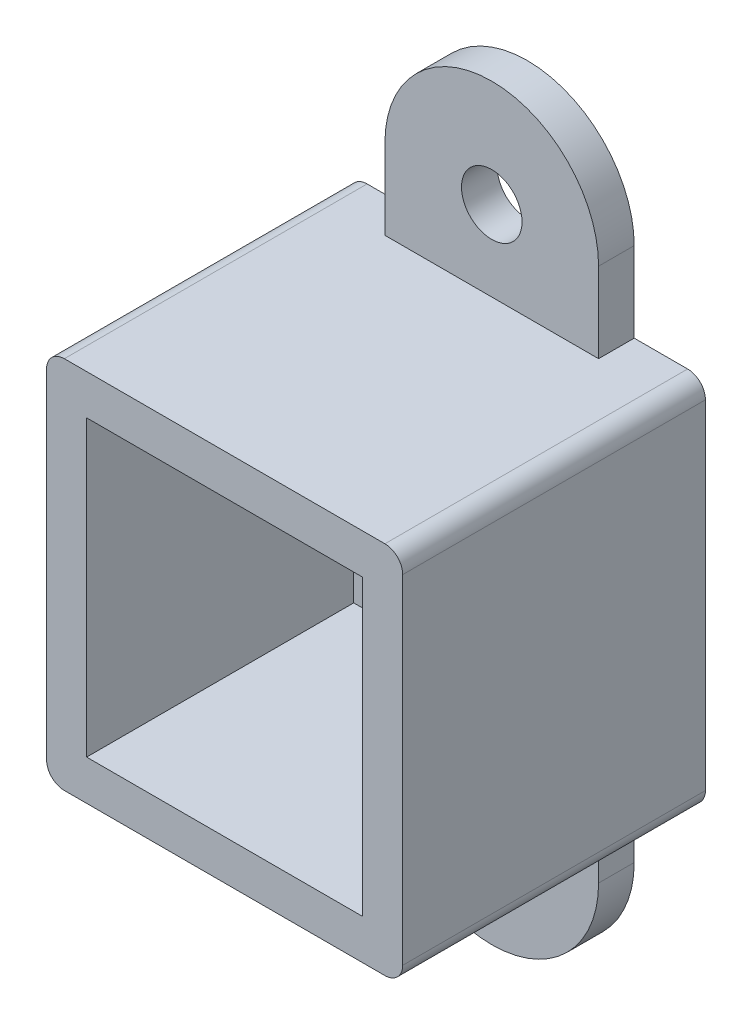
ISO-10303-21;
HEADER;
FILE_DESCRIPTION(('STEP AP214'),'2;1');
FILE_NAME('part.step','',(''),(''),'','','');
FILE_SCHEMA(('AUTOMOTIVE_DESIGN { 1 0 10303 214 1 1 1 1 }'));
ENDSEC;
DATA;
#1=APPLICATION_CONTEXT('core data for automotive mechanical design processes');
#2=APPLICATION_PROTOCOL_DEFINITION('international standard','automotive_design',2000,#1);
#3=PRODUCT_CONTEXT('',#1,'mechanical');
#4=PRODUCT('Part','Part','',(#3));
#5=PRODUCT_RELATED_PRODUCT_CATEGORY('part','',(#4));
#6=PRODUCT_DEFINITION_FORMATION('','',#4);
#7=PRODUCT_DEFINITION_CONTEXT('part definition',#1,'design');
#8=PRODUCT_DEFINITION('design','',#6,#7);
#9=PRODUCT_DEFINITION_SHAPE('','',#8);
#10=(LENGTH_UNIT() NAMED_UNIT(*) SI_UNIT(.MILLI.,.METRE.));
#11=(NAMED_UNIT(*) PLANE_ANGLE_UNIT() SI_UNIT($,.RADIAN.));
#12=(NAMED_UNIT(*) SI_UNIT($,.STERADIAN.) SOLID_ANGLE_UNIT());
#13=UNCERTAINTY_MEASURE_WITH_UNIT(LENGTH_MEASURE(1.E-05),#10,'distance_accuracy_value','');
#14=(GEOMETRIC_REPRESENTATION_CONTEXT(3) GLOBAL_UNCERTAINTY_ASSIGNED_CONTEXT((#13)) GLOBAL_UNIT_ASSIGNED_CONTEXT((#10,
#11,#12)) REPRESENTATION_CONTEXT('',''));
#15=CARTESIAN_POINT('',(0.,0.,0.));
#16=DIRECTION('',(0.,0.,1.));
#17=DIRECTION('',(1.,0.,0.));
#18=AXIS2_PLACEMENT_3D('',#15,#16,#17);
#19=CARTESIAN_POINT('',(7.75,-8.25,17.));
#20=DIRECTION('',(-1.,0.,0.));
#21=DIRECTION('',(0.,0.,1.));
#22=AXIS2_PLACEMENT_3D('',#19,#20,#21);
#23=PLANE('',#22);
#24=DIRECTION('',(0.,0.,-1.));
#25=VECTOR('',#24,1.);
#26=CARTESIAN_POINT('',(7.75,8.25,17.));
#27=LINE('',#26,#25);
#28=CARTESIAN_POINT('',(7.75,8.25,17.));
#29=VERTEX_POINT('',#28);
#30=CARTESIAN_POINT('',(7.75,8.25,2.));
#31=VERTEX_POINT('',#30);
#32=EDGE_CURVE('E272',#29,#31,#27,.T.);
#33=ORIENTED_EDGE('',*,*,#32,.T.);
#34=DIRECTION('',(0.,-1.,0.));
#35=VECTOR('',#34,1.);
#36=CARTESIAN_POINT('',(7.75,-8.25,2.));
#37=LINE('',#36,#35);
#38=CARTESIAN_POINT('',(7.75,-8.25,2.));
#39=VERTEX_POINT('',#38);
#40=EDGE_CURVE('E246',#31,#39,#37,.T.);
#41=ORIENTED_EDGE('',*,*,#40,.T.);
#42=DIRECTION('',(0.,0.,-1.));
#43=VECTOR('',#42,1.);
#44=CARTESIAN_POINT('',(7.75,-8.25,17.));
#45=LINE('',#44,#43);
#46=CARTESIAN_POINT('',(7.75,-8.25,17.));
#47=VERTEX_POINT('',#46);
#48=EDGE_CURVE('E263',#47,#39,#45,.T.);
#49=ORIENTED_EDGE('',*,*,#48,.F.);
#50=DIRECTION('',(0.,1.,0.));
#51=VECTOR('',#50,1.);
#52=CARTESIAN_POINT('',(7.75,-8.25,17.));
#53=LINE('',#52,#51);
#54=EDGE_CURVE('E254',#47,#29,#53,.T.);
#55=ORIENTED_EDGE('',*,*,#54,.T.);
#56=EDGE_LOOP('',(#33,#41,#49,#55));
#57=FACE_BOUND('',#56,.T.);
#58=ADVANCED_FACE('F32',(#57),#23,.T.);
#59=CARTESIAN_POINT('',(-7.75,8.25,17.));
#60=DIRECTION('',(0.,-1.,0.));
#61=DIRECTION('',(0.,0.,-1.));
#62=AXIS2_PLACEMENT_3D('',#59,#60,#61);
#63=PLANE('',#62);
#64=DIRECTION('',(0.,0.,-1.));
#65=VECTOR('',#64,1.);
#66=CARTESIAN_POINT('',(-7.75,8.25,17.));
#67=LINE('',#66,#65);
#68=CARTESIAN_POINT('',(-7.75,8.25,17.));
#69=VERTEX_POINT('',#68);
#70=CARTESIAN_POINT('',(-7.75,8.25,2.));
#71=VERTEX_POINT('',#70);
#72=EDGE_CURVE('E269',#69,#71,#67,.T.);
#73=ORIENTED_EDGE('',*,*,#72,.T.);
#74=DIRECTION('',(1.,0.,0.));
#75=VECTOR('',#74,1.);
#76=CARTESIAN_POINT('',(-7.75,8.25,2.));
#77=LINE('',#76,#75);
#78=EDGE_CURVE('E243',#71,#31,#77,.T.);
#79=ORIENTED_EDGE('',*,*,#78,.T.);
#80=ORIENTED_EDGE('',*,*,#32,.F.);
#81=DIRECTION('',(-1.,0.,0.));
#82=VECTOR('',#81,1.);
#83=CARTESIAN_POINT('',(-7.75,8.25,17.));
#84=LINE('',#83,#82);
#85=EDGE_CURVE('E256',#29,#69,#84,.T.);
#86=ORIENTED_EDGE('',*,*,#85,.T.);
#87=EDGE_LOOP('',(#73,#79,#80,#86));
#88=FACE_BOUND('',#87,.T.);
#89=ADVANCED_FACE('F370',(#88),#63,.T.);
#90=CARTESIAN_POINT('',(-7.75,-8.25,17.));
#91=DIRECTION('',(1.,0.,0.));
#92=DIRECTION('',(0.,0.,-1.));
#93=AXIS2_PLACEMENT_3D('',#90,#91,#92);
#94=PLANE('',#93);
#95=DIRECTION('',(0.,0.,-1.));
#96=VECTOR('',#95,1.);
#97=CARTESIAN_POINT('',(-7.75,-8.25,17.));
#98=LINE('',#97,#96);
#99=CARTESIAN_POINT('',(-7.75,-8.25,17.));
#100=VERTEX_POINT('',#99);
#101=CARTESIAN_POINT('',(-7.75,-8.25,2.));
#102=VERTEX_POINT('',#101);
#103=EDGE_CURVE('E266',#100,#102,#98,.T.);
#104=ORIENTED_EDGE('',*,*,#103,.T.);
#105=DIRECTION('',(0.,1.,0.));
#106=VECTOR('',#105,1.);
#107=CARTESIAN_POINT('',(-7.75,-8.25,2.));
#108=LINE('',#107,#106);
#109=EDGE_CURVE('E228',#102,#71,#108,.T.);
#110=ORIENTED_EDGE('',*,*,#109,.T.);
#111=ORIENTED_EDGE('',*,*,#72,.F.);
#112=DIRECTION('',(0.,-1.,0.));
#113=VECTOR('',#112,1.);
#114=CARTESIAN_POINT('',(-7.75,-8.25,17.));
#115=LINE('',#114,#113);
#116=EDGE_CURVE('E258',#69,#100,#115,.T.);
#117=ORIENTED_EDGE('',*,*,#116,.T.);
#118=EDGE_LOOP('',(#104,#110,#111,#117));
#119=FACE_BOUND('',#118,.T.);
#120=ADVANCED_FACE('F376',(#119),#94,.T.);
#121=CARTESIAN_POINT('',(-7.75,-8.25,17.));
#122=DIRECTION('',(0.,1.,0.));
#123=DIRECTION('',(0.,0.,1.));
#124=AXIS2_PLACEMENT_3D('',#121,#122,#123);
#125=PLANE('',#124);
#126=ORIENTED_EDGE('',*,*,#48,.T.);
#127=DIRECTION('',(-1.,0.,0.));
#128=VECTOR('',#127,1.);
#129=CARTESIAN_POINT('',(-7.75,-8.25,2.));
#130=LINE('',#129,#128);
#131=EDGE_CURVE('E287',#39,#102,#130,.T.);
#132=ORIENTED_EDGE('',*,*,#131,.T.);
#133=ORIENTED_EDGE('',*,*,#103,.F.);
#134=DIRECTION('',(1.,0.,0.));
#135=VECTOR('',#134,1.);
#136=CARTESIAN_POINT('',(-7.75,-8.25,17.));
#137=LINE('',#136,#135);
#138=EDGE_CURVE('E261',#100,#47,#137,.T.);
#139=ORIENTED_EDGE('',*,*,#138,.T.);
#140=EDGE_LOOP('',(#126,#132,#133,#139));
#141=FACE_BOUND('',#140,.T.);
#142=ADVANCED_FACE('F383',(#141),#125,.T.);
#143=CARTESIAN_POINT('',(0.,0.,17.));
#144=DIRECTION('',(0.,0.,-1.));
#145=DIRECTION('',(-1.,0.,0.));
#146=AXIS2_PLACEMENT_3D('',#143,#144,#145);
#147=PLANE('',#146);
#148=DIRECTION('',(0.,1.,0.));
#149=VECTOR('',#148,1.);
#150=CARTESIAN_POINT('',(10.,-10.5,17.));
#151=LINE('',#150,#149);
#152=CARTESIAN_POINT('',(10.,-9.5,17.));
#153=VERTEX_POINT('',#152);
#154=CARTESIAN_POINT('',(10.,9.49999999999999,17.));
#155=VERTEX_POINT('',#154);
#156=EDGE_CURVE('E276',#153,#155,#151,.T.);
#157=ORIENTED_EDGE('',*,*,#156,.T.);
#158=CARTESIAN_POINT('',(9.,9.5,17.));
#159=DIRECTION('',(0.,0.,-1.));
#160=DIRECTION('',(-1.,0.,0.));
#161=AXIS2_PLACEMENT_3D('',#158,#159,#160);
#162=CIRCLE('',#161,1.);
#163=CARTESIAN_POINT('',(9.,10.5,17.));
#164=VERTEX_POINT('',#163);
#165=EDGE_CURVE('E323',#155,#164,#162,.F.);
#166=ORIENTED_EDGE('',*,*,#165,.T.);
#167=DIRECTION('',(-1.,0.,0.));
#168=VECTOR('',#167,1.);
#169=CARTESIAN_POINT('',(-10.,10.5,17.));
#170=LINE('',#169,#168);
#171=CARTESIAN_POINT('',(-9.,10.5,17.));
#172=VERTEX_POINT('',#171);
#173=EDGE_CURVE('E279',#164,#172,#170,.T.);
#174=ORIENTED_EDGE('',*,*,#173,.T.);
#175=CARTESIAN_POINT('',(-9.,9.5,17.));
#176=DIRECTION('',(0.,0.,-1.));
#177=DIRECTION('',(-1.,0.,0.));
#178=AXIS2_PLACEMENT_3D('',#175,#176,#177);
#179=CIRCLE('',#178,1.);
#180=CARTESIAN_POINT('',(-10.,9.49999999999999,17.));
#181=VERTEX_POINT('',#180);
#182=EDGE_CURVE('E318',#172,#181,#179,.F.);
#183=ORIENTED_EDGE('',*,*,#182,.T.);
#184=DIRECTION('',(0.,-1.,0.));
#185=VECTOR('',#184,1.);
#186=CARTESIAN_POINT('',(-10.,-10.5,17.));
#187=LINE('',#186,#185);
#188=CARTESIAN_POINT('',(-10.,-9.5,17.));
#189=VERTEX_POINT('',#188);
#190=EDGE_CURVE('E283',#181,#189,#187,.T.);
#191=ORIENTED_EDGE('',*,*,#190,.T.);
#192=CARTESIAN_POINT('',(-9.,-9.5,17.));
#193=DIRECTION('',(0.,0.,-1.));
#194=DIRECTION('',(-1.,0.,0.));
#195=AXIS2_PLACEMENT_3D('',#192,#193,#194);
#196=CIRCLE('',#195,1.);
#197=CARTESIAN_POINT('',(-9.,-10.5,17.));
#198=VERTEX_POINT('',#197);
#199=EDGE_CURVE('E54',#189,#198,#196,.F.);
#200=ORIENTED_EDGE('',*,*,#199,.T.);
#201=DIRECTION('',(1.,0.,0.));
#202=VECTOR('',#201,1.);
#203=CARTESIAN_POINT('',(-10.,-10.5,17.));
#204=LINE('',#203,#202);
#205=CARTESIAN_POINT('',(9.,-10.5,17.));
#206=VERTEX_POINT('',#205);
#207=EDGE_CURVE('E285',#198,#206,#204,.T.);
#208=ORIENTED_EDGE('',*,*,#207,.T.);
#209=CARTESIAN_POINT('',(9.,-9.5,17.));
#210=DIRECTION('',(0.,0.,-1.));
#211=DIRECTION('',(-1.,0.,0.));
#212=AXIS2_PLACEMENT_3D('',#209,#210,#211);
#213=CIRCLE('',#212,1.);
#214=EDGE_CURVE('E321',#206,#153,#213,.F.);
#215=ORIENTED_EDGE('',*,*,#214,.T.);
#216=EDGE_LOOP('',(#157,#166,#174,#183,#191,#200,#208,#215));
#217=FACE_BOUND('',#216,.T.);
#218=ORIENTED_EDGE('',*,*,#54,.F.);
#219=ORIENTED_EDGE('',*,*,#138,.F.);
#220=ORIENTED_EDGE('',*,*,#116,.F.);
#221=ORIENTED_EDGE('',*,*,#85,.F.);
#222=EDGE_LOOP('',(#218,#219,#220,#221));
#223=FACE_BOUND('',#222,.T.);
#224=ADVANCED_FACE('F347',(#217,#223),#147,.F.);
#225=CARTESIAN_POINT('',(0.,0.,0.));
#226=DIRECTION('',(0.,0.,-1.));
#227=DIRECTION('',(-1.,0.,0.));
#228=AXIS2_PLACEMENT_3D('',#225,#226,#227);
#229=PLANE('',#228);
#230=CARTESIAN_POINT('',(0.,15.,0.));
#231=DIRECTION('',(0.,0.,1.));
#232=DIRECTION('',(1.,0.,0.));
#233=AXIS2_PLACEMENT_3D('',#230,#231,#232);
#234=CIRCLE('',#233,1.7);
#235=CARTESIAN_POINT('',(1.7,15.,0.));
#236=VERTEX_POINT('',#235);
#237=EDGE_CURVE('E608',#236,#236,#234,.T.);
#238=ORIENTED_EDGE('',*,*,#237,.T.);
#239=EDGE_LOOP('',(#238));
#240=FACE_BOUND('',#239,.T.);
#241=CARTESIAN_POINT('',(0.,-15.,0.));
#242=DIRECTION('',(0.,0.,1.));
#243=DIRECTION('',(1.,0.,0.));
#244=AXIS2_PLACEMENT_3D('',#241,#242,#243);
#245=CIRCLE('',#244,1.7);
#246=CARTESIAN_POINT('',(1.7,-15.,0.));
#247=VERTEX_POINT('',#246);
#248=EDGE_CURVE('E201',#247,#247,#245,.T.);
#249=ORIENTED_EDGE('',*,*,#248,.T.);
#250=EDGE_LOOP('',(#249));
#251=FACE_BOUND('',#250,.T.);
#252=DIRECTION('',(-1.,0.,0.));
#253=VECTOR('',#252,1.);
#254=CARTESIAN_POINT('',(-10.,10.5,0.));
#255=LINE('',#254,#253);
#256=CARTESIAN_POINT('',(9.,10.5,0.));
#257=VERTEX_POINT('',#256);
#258=CARTESIAN_POINT('',(6.,10.5,0.));
#259=VERTEX_POINT('',#258);
#260=EDGE_CURVE('E291',#257,#259,#255,.T.);
#261=ORIENTED_EDGE('',*,*,#260,.F.);
#262=CARTESIAN_POINT('',(9.,9.5,0.));
#263=DIRECTION('',(0.,0.,-1.));
#264=DIRECTION('',(-1.,0.,0.));
#265=AXIS2_PLACEMENT_3D('',#262,#263,#264);
#266=CIRCLE('',#265,1.);
#267=CARTESIAN_POINT('',(10.,9.49999999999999,0.));
#268=VERTEX_POINT('',#267);
#269=EDGE_CURVE('E311',#257,#268,#266,.T.);
#270=ORIENTED_EDGE('',*,*,#269,.T.);
#271=DIRECTION('',(0.,1.,0.));
#272=VECTOR('',#271,1.);
#273=CARTESIAN_POINT('',(10.,-10.5,0.));
#274=LINE('',#273,#272);
#275=CARTESIAN_POINT('',(10.,-9.5,0.));
#276=VERTEX_POINT('',#275);
#277=EDGE_CURVE('E275',#276,#268,#274,.T.);
#278=ORIENTED_EDGE('',*,*,#277,.F.);
#279=CARTESIAN_POINT('',(9.,-9.5,0.));
#280=DIRECTION('',(0.,0.,-1.));
#281=DIRECTION('',(-1.,0.,0.));
#282=AXIS2_PLACEMENT_3D('',#279,#280,#281);
#283=CIRCLE('',#282,1.);
#284=CARTESIAN_POINT('',(9.,-10.5,0.));
#285=VERTEX_POINT('',#284);
#286=EDGE_CURVE('E309',#276,#285,#283,.T.);
#287=ORIENTED_EDGE('',*,*,#286,.T.);
#288=DIRECTION('',(1.,0.,0.));
#289=VECTOR('',#288,1.);
#290=CARTESIAN_POINT('',(-10.,-10.5,0.));
#291=LINE('',#290,#289);
#292=CARTESIAN_POINT('',(6.,-10.5,0.));
#293=VERTEX_POINT('',#292);
#294=EDGE_CURVE('E296',#293,#285,#291,.T.);
#295=ORIENTED_EDGE('',*,*,#294,.F.);
#296=DIRECTION('',(0.,-1.,0.));
#297=VECTOR('',#296,1.);
#298=CARTESIAN_POINT('',(6.,-15.,0.));
#299=LINE('',#298,#297);
#300=CARTESIAN_POINT('',(6.,-15.,0.));
#301=VERTEX_POINT('',#300);
#302=EDGE_CURVE('E220',#293,#301,#299,.T.);
#303=ORIENTED_EDGE('',*,*,#302,.T.);
#304=CARTESIAN_POINT('',(0.,-15.,0.));
#305=DIRECTION('',(0.,0.,-1.));
#306=DIRECTION('',(-1.,0.,0.));
#307=AXIS2_PLACEMENT_3D('',#304,#305,#306);
#308=CIRCLE('',#307,6.);
#309=CARTESIAN_POINT('',(-6.,-15.,0.));
#310=VERTEX_POINT('',#309);
#311=EDGE_CURVE('E198',#301,#310,#308,.T.);
#312=ORIENTED_EDGE('',*,*,#311,.T.);
#313=DIRECTION('',(0.,1.,0.));
#314=VECTOR('',#313,1.);
#315=CARTESIAN_POINT('',(-6.,-15.,0.));
#316=LINE('',#315,#314);
#317=CARTESIAN_POINT('',(-6.,-10.5,0.));
#318=VERTEX_POINT('',#317);
#319=EDGE_CURVE('E195',#310,#318,#316,.T.);
#320=ORIENTED_EDGE('',*,*,#319,.T.);
#321=CARTESIAN_POINT('',(-9.,-10.5,0.));
#322=VERTEX_POINT('',#321);
#323=EDGE_CURVE('E280',#322,#318,#291,.T.);
#324=ORIENTED_EDGE('',*,*,#323,.F.);
#325=CARTESIAN_POINT('',(-9.,-9.5,0.));
#326=DIRECTION('',(0.,0.,-1.));
#327=DIRECTION('',(-1.,0.,0.));
#328=AXIS2_PLACEMENT_3D('',#325,#326,#327);
#329=CIRCLE('',#328,1.);
#330=CARTESIAN_POINT('',(-10.,-9.5,0.));
#331=VERTEX_POINT('',#330);
#332=EDGE_CURVE('E307',#322,#331,#329,.T.);
#333=ORIENTED_EDGE('',*,*,#332,.T.);
#334=DIRECTION('',(0.,-1.,0.));
#335=VECTOR('',#334,1.);
#336=CARTESIAN_POINT('',(-10.,-10.5,0.));
#337=LINE('',#336,#335);
#338=CARTESIAN_POINT('',(-10.,9.49999999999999,0.));
#339=VERTEX_POINT('',#338);
#340=EDGE_CURVE('E293',#339,#331,#337,.T.);
#341=ORIENTED_EDGE('',*,*,#340,.F.);
#342=CARTESIAN_POINT('',(-9.,9.5,0.));
#343=DIRECTION('',(0.,0.,-1.));
#344=DIRECTION('',(-1.,0.,0.));
#345=AXIS2_PLACEMENT_3D('',#342,#343,#344);
#346=CIRCLE('',#345,1.);
#347=CARTESIAN_POINT('',(-9.,10.5,0.));
#348=VERTEX_POINT('',#347);
#349=EDGE_CURVE('E305',#339,#348,#346,.T.);
#350=ORIENTED_EDGE('',*,*,#349,.T.);
#351=CARTESIAN_POINT('',(-5.99999999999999,10.5,0.));
#352=VERTEX_POINT('',#351);
#353=EDGE_CURVE('E290',#352,#348,#255,.T.);
#354=ORIENTED_EDGE('',*,*,#353,.F.);
#355=DIRECTION('',(0.,1.,0.));
#356=VECTOR('',#355,1.);
#357=CARTESIAN_POINT('',(-5.99999999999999,10.5,0.));
#358=LINE('',#357,#356);
#359=CARTESIAN_POINT('',(-6.,15.,0.));
#360=VERTEX_POINT('',#359);
#361=EDGE_CURVE('E214',#352,#360,#358,.T.);
#362=ORIENTED_EDGE('',*,*,#361,.T.);
#363=CARTESIAN_POINT('',(0.,15.,0.));
#364=DIRECTION('',(0.,0.,-1.));
#365=DIRECTION('',(-1.,0.,0.));
#366=AXIS2_PLACEMENT_3D('',#363,#364,#365);
#367=CIRCLE('',#366,6.);
#368=CARTESIAN_POINT('',(6.,15.,0.));
#369=VERTEX_POINT('',#368);
#370=EDGE_CURVE('E175',#360,#369,#367,.T.);
#371=ORIENTED_EDGE('',*,*,#370,.T.);
#372=DIRECTION('',(0.,-1.,0.));
#373=VECTOR('',#372,1.);
#374=CARTESIAN_POINT('',(6.,10.5,0.));
#375=LINE('',#374,#373);
#376=EDGE_CURVE('E217',#369,#259,#375,.T.);
#377=ORIENTED_EDGE('',*,*,#376,.T.);
#378=EDGE_LOOP('',(#261,#270,#278,#287,#295,#303,#312,#320,#324,#333,#341,#350,#354,#362,#371,#377));
#379=FACE_BOUND('',#378,.T.);
#380=ADVANCED_FACE('F339',(#240,#251,#379),#229,.T.);
#381=CARTESIAN_POINT('',(10.,-10.5,17.));
#382=DIRECTION('',(-1.,0.,0.));
#383=DIRECTION('',(0.,0.,1.));
#384=AXIS2_PLACEMENT_3D('',#381,#382,#383);
#385=PLANE('',#384);
#386=ORIENTED_EDGE('',*,*,#277,.T.);
#387=DIRECTION('',(0.,0.,-1.));
#388=VECTOR('',#387,1.);
#389=CARTESIAN_POINT('',(10.,9.5,17.));
#390=LINE('',#389,#388);
#391=EDGE_CURVE('E316',#268,#155,#390,.F.);
#392=ORIENTED_EDGE('',*,*,#391,.T.);
#393=ORIENTED_EDGE('',*,*,#156,.F.);
#394=DIRECTION('',(0.,0.,-1.));
#395=VECTOR('',#394,1.);
#396=CARTESIAN_POINT('',(10.,-9.5,17.));
#397=LINE('',#396,#395);
#398=EDGE_CURVE('E313',#153,#276,#397,.T.);
#399=ORIENTED_EDGE('',*,*,#398,.T.);
#400=EDGE_LOOP('',(#386,#392,#393,#399));
#401=FACE_BOUND('',#400,.T.);
#402=ADVANCED_FACE('F355',(#401),#385,.F.);
#403=CARTESIAN_POINT('',(-10.,10.5,17.));
#404=DIRECTION('',(0.,-1.,0.));
#405=DIRECTION('',(0.,0.,-1.));
#406=AXIS2_PLACEMENT_3D('',#403,#404,#405);
#407=PLANE('',#406);
#408=ORIENTED_EDGE('',*,*,#173,.F.);
#409=DIRECTION('',(0.,0.,-1.));
#410=VECTOR('',#409,1.);
#411=CARTESIAN_POINT('',(9.,10.5,17.));
#412=LINE('',#411,#410);
#413=EDGE_CURVE('E302',#164,#257,#412,.T.);
#414=ORIENTED_EDGE('',*,*,#413,.T.);
#415=ORIENTED_EDGE('',*,*,#260,.T.);
#416=DIRECTION('',(0.,0.,-1.));
#417=VECTOR('',#416,1.);
#418=CARTESIAN_POINT('',(6.,10.5,2.));
#419=LINE('',#418,#417);
#420=CARTESIAN_POINT('',(6.,10.5,2.));
#421=VERTEX_POINT('',#420);
#422=EDGE_CURVE('E236',#421,#259,#419,.T.);
#423=ORIENTED_EDGE('',*,*,#422,.F.);
#424=DIRECTION('',(1.,0.,0.));
#425=VECTOR('',#424,1.);
#426=CARTESIAN_POINT('',(-10.,10.5,2.));
#427=LINE('',#426,#425);
#428=CARTESIAN_POINT('',(-5.99999999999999,10.5,2.));
#429=VERTEX_POINT('',#428);
#430=EDGE_CURVE('E252',#429,#421,#427,.T.);
#431=ORIENTED_EDGE('',*,*,#430,.F.);
#432=DIRECTION('',(0.,0.,-1.));
#433=VECTOR('',#432,1.);
#434=CARTESIAN_POINT('',(-5.99999999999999,10.5,2.));
#435=LINE('',#434,#433);
#436=EDGE_CURVE('E181',#429,#352,#435,.T.);
#437=ORIENTED_EDGE('',*,*,#436,.T.);
#438=ORIENTED_EDGE('',*,*,#353,.T.);
#439=DIRECTION('',(0.,0.,-1.));
#440=VECTOR('',#439,1.);
#441=CARTESIAN_POINT('',(-9.,10.5,17.));
#442=LINE('',#441,#440);
#443=EDGE_CURVE('E300',#348,#172,#442,.F.);
#444=ORIENTED_EDGE('',*,*,#443,.T.);
#445=EDGE_LOOP('',(#408,#414,#415,#423,#431,#437,#438,#444));
#446=FACE_BOUND('',#445,.T.);
#447=ADVANCED_FACE('F363',(#446),#407,.F.);
#448=CARTESIAN_POINT('',(-10.,-10.5,17.));
#449=DIRECTION('',(1.,0.,0.));
#450=DIRECTION('',(0.,0.,-1.));
#451=AXIS2_PLACEMENT_3D('',#448,#449,#450);
#452=PLANE('',#451);
#453=ORIENTED_EDGE('',*,*,#340,.T.);
#454=DIRECTION('',(0.,0.,-1.));
#455=VECTOR('',#454,1.);
#456=CARTESIAN_POINT('',(-10.,-9.5,17.));
#457=LINE('',#456,#455);
#458=EDGE_CURVE('E11',#331,#189,#457,.F.);
#459=ORIENTED_EDGE('',*,*,#458,.T.);
#460=ORIENTED_EDGE('',*,*,#190,.F.);
#461=DIRECTION('',(0.,0.,-1.));
#462=VECTOR('',#461,1.);
#463=CARTESIAN_POINT('',(-10.,9.5,17.));
#464=LINE('',#463,#462);
#465=EDGE_CURVE('E40',#181,#339,#464,.T.);
#466=ORIENTED_EDGE('',*,*,#465,.T.);
#467=EDGE_LOOP('',(#453,#459,#460,#466));
#468=FACE_BOUND('',#467,.T.);
#469=ADVANCED_FACE('F333',(#468),#452,.F.);
#470=CARTESIAN_POINT('',(-10.,-10.5,17.));
#471=DIRECTION('',(0.,1.,0.));
#472=DIRECTION('',(0.,0.,1.));
#473=AXIS2_PLACEMENT_3D('',#470,#471,#472);
#474=PLANE('',#473);
#475=ORIENTED_EDGE('',*,*,#294,.T.);
#476=DIRECTION('',(0.,0.,-1.));
#477=VECTOR('',#476,1.);
#478=CARTESIAN_POINT('',(9.,-10.5,17.));
#479=LINE('',#478,#477);
#480=EDGE_CURVE('E47',#285,#206,#479,.F.);
#481=ORIENTED_EDGE('',*,*,#480,.T.);
#482=ORIENTED_EDGE('',*,*,#207,.F.);
#483=DIRECTION('',(0.,0.,-1.));
#484=VECTOR('',#483,1.);
#485=CARTESIAN_POINT('',(-9.,-10.5,17.));
#486=LINE('',#485,#484);
#487=EDGE_CURVE('E325',#198,#322,#486,.T.);
#488=ORIENTED_EDGE('',*,*,#487,.T.);
#489=ORIENTED_EDGE('',*,*,#323,.T.);
#490=DIRECTION('',(0.,0.,-1.));
#491=VECTOR('',#490,1.);
#492=CARTESIAN_POINT('',(-6.,-10.5,2.));
#493=LINE('',#492,#491);
#494=CARTESIAN_POINT('',(-6.,-10.5,2.));
#495=VERTEX_POINT('',#494);
#496=EDGE_CURVE('E225',#495,#318,#493,.T.);
#497=ORIENTED_EDGE('',*,*,#496,.F.);
#498=DIRECTION('',(-1.,0.,0.));
#499=VECTOR('',#498,1.);
#500=CARTESIAN_POINT('',(-10.,-10.5,2.));
#501=LINE('',#500,#499);
#502=CARTESIAN_POINT('',(6.,-10.5,2.));
#503=VERTEX_POINT('',#502);
#504=EDGE_CURVE('E249',#503,#495,#501,.T.);
#505=ORIENTED_EDGE('',*,*,#504,.F.);
#506=DIRECTION('',(0.,0.,-1.));
#507=VECTOR('',#506,1.);
#508=CARTESIAN_POINT('',(6.,-10.5,2.));
#509=LINE('',#508,#507);
#510=EDGE_CURVE('E233',#503,#293,#509,.T.);
#511=ORIENTED_EDGE('',*,*,#510,.T.);
#512=EDGE_LOOP('',(#475,#481,#482,#488,#489,#497,#505,#511));
#513=FACE_BOUND('',#512,.T.);
#514=ADVANCED_FACE('F345',(#513),#474,.F.);
#515=CARTESIAN_POINT('',(0.,-15.,2.));
#516=DIRECTION('',(0.,0.,-1.));
#517=DIRECTION('',(-1.,0.,0.));
#518=AXIS2_PLACEMENT_3D('',#515,#516,#517);
#519=PLANE('',#518);
#520=ORIENTED_EDGE('',*,*,#40,.F.);
#521=ORIENTED_EDGE('',*,*,#78,.F.);
#522=ORIENTED_EDGE('',*,*,#109,.F.);
#523=ORIENTED_EDGE('',*,*,#131,.F.);
#524=EDGE_LOOP('',(#520,#521,#522,#523));
#525=FACE_BOUND('',#524,.T.);
#526=ADVANCED_FACE('F389',(#525),#519,.F.);
#527=CARTESIAN_POINT('',(0.,-15.,2.));
#528=DIRECTION('',(0.,0.,-1.));
#529=DIRECTION('',(-1.,0.,0.));
#530=AXIS2_PLACEMENT_3D('',#527,#528,#529);
#531=CYLINDRICAL_SURFACE('',#530,6.);
#532=ORIENTED_EDGE('',*,*,#311,.F.);
#533=DIRECTION('',(0.,0.,-1.));
#534=VECTOR('',#533,1.);
#535=CARTESIAN_POINT('',(6.,-15.,2.));
#536=LINE('',#535,#534);
#537=CARTESIAN_POINT('',(6.,-15.,2.));
#538=VERTEX_POINT('',#537);
#539=EDGE_CURVE('E231',#538,#301,#536,.T.);
#540=ORIENTED_EDGE('',*,*,#539,.F.);
#541=CARTESIAN_POINT('',(0.,-15.,2.));
#542=DIRECTION('',(0.,0.,-1.));
#543=DIRECTION('',(-1.,0.,0.));
#544=AXIS2_PLACEMENT_3D('',#541,#542,#543);
#545=CIRCLE('',#544,6.);
#546=CARTESIAN_POINT('',(-6.,-15.,2.));
#547=VERTEX_POINT('',#546);
#548=EDGE_CURVE('E208',#538,#547,#545,.T.);
#549=ORIENTED_EDGE('',*,*,#548,.T.);
#550=DIRECTION('',(0.,0.,-1.));
#551=VECTOR('',#550,1.);
#552=CARTESIAN_POINT('',(-6.,-15.,2.));
#553=LINE('',#552,#551);
#554=EDGE_CURVE('E229',#547,#310,#553,.T.);
#555=ORIENTED_EDGE('',*,*,#554,.T.);
#556=EDGE_LOOP('',(#532,#540,#549,#555));
#557=FACE_BOUND('',#556,.T.);
#558=ADVANCED_FACE('F498',(#557),#531,.T.);
#559=CARTESIAN_POINT('',(0.,-15.,2.));
#560=DIRECTION('',(0.,0.,1.));
#561=DIRECTION('',(1.,0.,0.));
#562=AXIS2_PLACEMENT_3D('',#559,#560,#561);
#563=CIRCLE('',#562,1.7);
#564=CARTESIAN_POINT('',(1.7,-15.,2.));
#565=VERTEX_POINT('',#564);
#566=EDGE_CURVE('E606',#565,#565,#563,.T.);
#567=ORIENTED_EDGE('',*,*,#566,.F.);
#568=EDGE_LOOP('',(#567));
#569=FACE_BOUND('',#568,.T.);
#570=DIRECTION('',(0.,-1.,0.));
#571=VECTOR('',#570,1.);
#572=CARTESIAN_POINT('',(6.,-15.,2.));
#573=LINE('',#572,#571);
#574=EDGE_CURVE('E205',#503,#538,#573,.T.);
#575=ORIENTED_EDGE('',*,*,#574,.F.);
#576=ORIENTED_EDGE('',*,*,#504,.T.);
#577=DIRECTION('',(0.,1.,0.));
#578=VECTOR('',#577,1.);
#579=CARTESIAN_POINT('',(-6.,-15.,2.));
#580=LINE('',#579,#578);
#581=EDGE_CURVE('E211',#547,#495,#580,.T.);
#582=ORIENTED_EDGE('',*,*,#581,.F.);
#583=ORIENTED_EDGE('',*,*,#548,.F.);
#584=EDGE_LOOP('',(#575,#576,#582,#583));
#585=FACE_BOUND('',#584,.T.);
#586=ADVANCED_FACE('F475',(#569,#585),#519,.F.);
#587=CARTESIAN_POINT('',(6.,-15.,2.));
#588=DIRECTION('',(1.,0.,0.));
#589=DIRECTION('',(0.,0.,-1.));
#590=AXIS2_PLACEMENT_3D('',#587,#588,#589);
#591=PLANE('',#590);
#592=ORIENTED_EDGE('',*,*,#302,.F.);
#593=ORIENTED_EDGE('',*,*,#510,.F.);
#594=ORIENTED_EDGE('',*,*,#574,.T.);
#595=ORIENTED_EDGE('',*,*,#539,.T.);
#596=EDGE_LOOP('',(#592,#593,#594,#595));
#597=FACE_BOUND('',#596,.T.);
#598=ADVANCED_FACE('F481',(#597),#591,.T.);
#599=CARTESIAN_POINT('',(-6.,-15.,2.));
#600=DIRECTION('',(-1.,0.,0.));
#601=DIRECTION('',(0.,0.,1.));
#602=AXIS2_PLACEMENT_3D('',#599,#600,#601);
#603=PLANE('',#602);
#604=ORIENTED_EDGE('',*,*,#319,.F.);
#605=ORIENTED_EDGE('',*,*,#554,.F.);
#606=ORIENTED_EDGE('',*,*,#581,.T.);
#607=ORIENTED_EDGE('',*,*,#496,.T.);
#608=EDGE_LOOP('',(#604,#605,#606,#607));
#609=FACE_BOUND('',#608,.T.);
#610=ADVANCED_FACE('F472',(#609),#603,.T.);
#611=CARTESIAN_POINT('',(0.,15.,2.));
#612=DIRECTION('',(0.,0.,1.));
#613=DIRECTION('',(1.,0.,0.));
#614=AXIS2_PLACEMENT_3D('',#611,#612,#613);
#615=CIRCLE('',#614,1.7);
#616=CARTESIAN_POINT('',(1.7,15.,2.));
#617=VERTEX_POINT('',#616);
#618=EDGE_CURVE('E611',#617,#617,#615,.T.);
#619=ORIENTED_EDGE('',*,*,#618,.F.);
#620=EDGE_LOOP('',(#619));
#621=FACE_BOUND('',#620,.T.);
#622=DIRECTION('',(0.,1.,0.));
#623=VECTOR('',#622,1.);
#624=CARTESIAN_POINT('',(-5.99999999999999,10.5,2.));
#625=LINE('',#624,#623);
#626=CARTESIAN_POINT('',(-6.,15.,2.));
#627=VERTEX_POINT('',#626);
#628=EDGE_CURVE('E188',#429,#627,#625,.T.);
#629=ORIENTED_EDGE('',*,*,#628,.F.);
#630=ORIENTED_EDGE('',*,*,#430,.T.);
#631=DIRECTION('',(0.,-1.,0.));
#632=VECTOR('',#631,1.);
#633=CARTESIAN_POINT('',(6.,10.5,2.));
#634=LINE('',#633,#632);
#635=CARTESIAN_POINT('',(6.,15.,2.));
#636=VERTEX_POINT('',#635);
#637=EDGE_CURVE('E190',#636,#421,#634,.T.);
#638=ORIENTED_EDGE('',*,*,#637,.F.);
#639=CARTESIAN_POINT('',(0.,15.,2.));
#640=DIRECTION('',(0.,0.,-1.));
#641=DIRECTION('',(-1.,0.,0.));
#642=AXIS2_PLACEMENT_3D('',#639,#640,#641);
#643=CIRCLE('',#642,6.);
#644=EDGE_CURVE('E173',#627,#636,#643,.T.);
#645=ORIENTED_EDGE('',*,*,#644,.F.);
#646=EDGE_LOOP('',(#629,#630,#638,#645));
#647=FACE_BOUND('',#646,.T.);
#648=ADVANCED_FACE('F186',(#621,#647),#519,.F.);
#649=CARTESIAN_POINT('',(6.,10.5,2.));
#650=DIRECTION('',(1.,0.,0.));
#651=DIRECTION('',(0.,0.,-1.));
#652=AXIS2_PLACEMENT_3D('',#649,#650,#651);
#653=PLANE('',#652);
#654=ORIENTED_EDGE('',*,*,#376,.F.);
#655=DIRECTION('',(0.,0.,-1.));
#656=VECTOR('',#655,1.);
#657=CARTESIAN_POINT('',(6.,15.,2.));
#658=LINE('',#657,#656);
#659=EDGE_CURVE('E180',#636,#369,#658,.T.);
#660=ORIENTED_EDGE('',*,*,#659,.F.);
#661=ORIENTED_EDGE('',*,*,#637,.T.);
#662=ORIENTED_EDGE('',*,*,#422,.T.);
#663=EDGE_LOOP('',(#654,#660,#661,#662));
#664=FACE_BOUND('',#663,.T.);
#665=ADVANCED_FACE('F456',(#664),#653,.T.);
#666=CARTESIAN_POINT('',(0.,15.,2.));
#667=DIRECTION('',(0.,0.,-1.));
#668=DIRECTION('',(-1.,0.,0.));
#669=AXIS2_PLACEMENT_3D('',#666,#667,#668);
#670=CYLINDRICAL_SURFACE('',#669,6.);
#671=ORIENTED_EDGE('',*,*,#370,.F.);
#672=DIRECTION('',(0.,0.,-1.));
#673=VECTOR('',#672,1.);
#674=CARTESIAN_POINT('',(-6.,15.,2.));
#675=LINE('',#674,#673);
#676=EDGE_CURVE('E170',#627,#360,#675,.T.);
#677=ORIENTED_EDGE('',*,*,#676,.F.);
#678=ORIENTED_EDGE('',*,*,#644,.T.);
#679=ORIENTED_EDGE('',*,*,#659,.T.);
#680=EDGE_LOOP('',(#671,#677,#678,#679));
#681=FACE_BOUND('',#680,.T.);
#682=ADVANCED_FACE('F172',(#681),#670,.T.);
#683=CARTESIAN_POINT('',(-5.99999999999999,10.5,2.));
#684=DIRECTION('',(-1.,0.,0.));
#685=DIRECTION('',(0.,-1.,0.));
#686=AXIS2_PLACEMENT_3D('',#683,#684,#685);
#687=PLANE('',#686);
#688=ORIENTED_EDGE('',*,*,#361,.F.);
#689=ORIENTED_EDGE('',*,*,#436,.F.);
#690=ORIENTED_EDGE('',*,*,#628,.T.);
#691=ORIENTED_EDGE('',*,*,#676,.T.);
#692=EDGE_LOOP('',(#688,#689,#690,#691));
#693=FACE_BOUND('',#692,.T.);
#694=ADVANCED_FACE('F193',(#693),#687,.T.);
#695=CARTESIAN_POINT('',(0.,-15.,2.));
#696=DIRECTION('',(0.,0.,1.));
#697=DIRECTION('',(1.,0.,0.));
#698=AXIS2_PLACEMENT_3D('',#695,#696,#697);
#699=CYLINDRICAL_SURFACE('',#698,1.7);
#700=ORIENTED_EDGE('',*,*,#248,.F.);
#701=EDGE_LOOP('',(#700));
#702=FACE_BOUND('',#701,.T.);
#703=ORIENTED_EDGE('',*,*,#566,.T.);
#704=EDGE_LOOP('',(#703));
#705=FACE_BOUND('',#704,.T.);
#706=ADVANCED_FACE('F429',(#702,#705),#699,.F.);
#707=CARTESIAN_POINT('',(0.,15.,2.));
#708=DIRECTION('',(0.,0.,1.));
#709=DIRECTION('',(1.,0.,0.));
#710=AXIS2_PLACEMENT_3D('',#707,#708,#709);
#711=CYLINDRICAL_SURFACE('',#710,1.7);
#712=ORIENTED_EDGE('',*,*,#237,.F.);
#713=EDGE_LOOP('',(#712));
#714=FACE_BOUND('',#713,.T.);
#715=ORIENTED_EDGE('',*,*,#618,.T.);
#716=EDGE_LOOP('',(#715));
#717=FACE_BOUND('',#716,.T.);
#718=ADVANCED_FACE('F398',(#714,#717),#711,.F.);
#719=CARTESIAN_POINT('',(9.,9.5,17.));
#720=DIRECTION('',(0.,0.,-1.));
#721=DIRECTION('',(-1.,0.,0.));
#722=AXIS2_PLACEMENT_3D('',#719,#720,#721);
#723=CYLINDRICAL_SURFACE('',#722,1.);
#724=ORIENTED_EDGE('',*,*,#165,.F.);
#725=ORIENTED_EDGE('',*,*,#391,.F.);
#726=ORIENTED_EDGE('',*,*,#269,.F.);
#727=ORIENTED_EDGE('',*,*,#413,.F.);
#728=EDGE_LOOP('',(#724,#725,#726,#727));
#729=FACE_BOUND('',#728,.T.);
#730=ADVANCED_FACE('F360',(#729),#723,.T.);
#731=CARTESIAN_POINT('',(9.,-9.5,17.));
#732=DIRECTION('',(0.,0.,-1.));
#733=DIRECTION('',(-1.,0.,0.));
#734=AXIS2_PLACEMENT_3D('',#731,#732,#733);
#735=CYLINDRICAL_SURFACE('',#734,1.);
#736=ORIENTED_EDGE('',*,*,#214,.F.);
#737=ORIENTED_EDGE('',*,*,#480,.F.);
#738=ORIENTED_EDGE('',*,*,#286,.F.);
#739=ORIENTED_EDGE('',*,*,#398,.F.);
#740=EDGE_LOOP('',(#736,#737,#738,#739));
#741=FACE_BOUND('',#740,.T.);
#742=ADVANCED_FACE('F352',(#741),#735,.T.);
#743=CARTESIAN_POINT('',(-9.,-9.5,17.));
#744=DIRECTION('',(0.,0.,-1.));
#745=DIRECTION('',(-1.,0.,0.));
#746=AXIS2_PLACEMENT_3D('',#743,#744,#745);
#747=CYLINDRICAL_SURFACE('',#746,1.);
#748=ORIENTED_EDGE('',*,*,#199,.F.);
#749=ORIENTED_EDGE('',*,*,#458,.F.);
#750=ORIENTED_EDGE('',*,*,#332,.F.);
#751=ORIENTED_EDGE('',*,*,#487,.F.);
#752=EDGE_LOOP('',(#748,#749,#750,#751));
#753=FACE_BOUND('',#752,.T.);
#754=ADVANCED_FACE('F344',(#753),#747,.T.);
#755=CARTESIAN_POINT('',(-9.,9.5,17.));
#756=DIRECTION('',(0.,0.,-1.));
#757=DIRECTION('',(-1.,0.,0.));
#758=AXIS2_PLACEMENT_3D('',#755,#756,#757);
#759=CYLINDRICAL_SURFACE('',#758,1.);
#760=ORIENTED_EDGE('',*,*,#182,.F.);
#761=ORIENTED_EDGE('',*,*,#443,.F.);
#762=ORIENTED_EDGE('',*,*,#349,.F.);
#763=ORIENTED_EDGE('',*,*,#465,.F.);
#764=EDGE_LOOP('',(#760,#761,#762,#763));
#765=FACE_BOUND('',#764,.T.);
#766=ADVANCED_FACE('F34',(#765),#759,.T.);
#767=CLOSED_SHELL('',(#58,#89,#120,#142,#224,#380,#402,#447,#469,#514,#526,#558,#586,#598,#610,
#648,#665,#682,#694,#706,#718,#730,#742,#754,#766));
#768=MANIFOLD_SOLID_BREP('B2',#767);
#769=ADVANCED_BREP_SHAPE_REPRESENTATION('',(#18,#768),#14);
#770=SHAPE_DEFINITION_REPRESENTATION(#9,#769);
ENDSEC;
END-ISO-10303-21;
